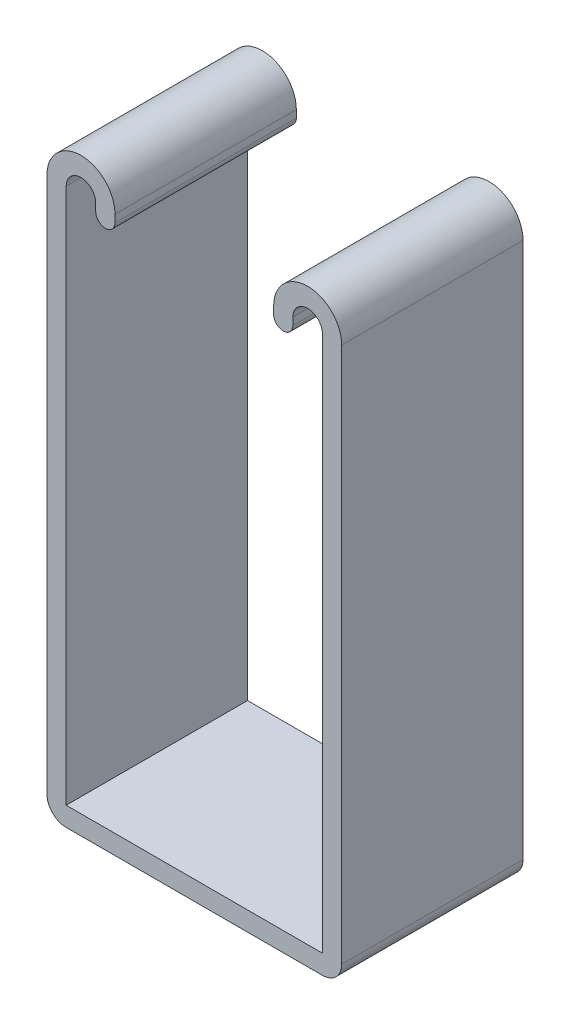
from build123d import *

# Parameters (mm, degrees)
BASE_EXTRUDE_DEPTH = 12.7


with BuildPart() as part:
    # Sketch1 → Base-Extrude (new, symmetric)
    with BuildSketch(Plane.XY):
        with BuildLine():
            Line((-20.6375, 39.6875), (-20.6375, -35.4076))
            ThreePointArc((-20.6375, -35.4076), (-19.848914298, -37.311414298), (-17.9451, -38.1))
            Line((-17.9451, -38.1), (17.9451, -38.1))
            ThreePointArc((17.9451, -38.1), (19.848914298, -37.311414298), (20.6375, -35.4076))
            Line((20.6375, -35.4076), (20.6375, 39.6875))
            ThreePointArc((20.6375, 39.6875), (15.875, 44.45), (11.1125, 39.6875))
            Line((11.1125, 39.6875), (11.1125, 38.65245))
            ThreePointArc((11.1125, 38.65245), (12.4587, 37.30625), (13.8049, 38.65245))
            Line((13.8049, 38.65245), (13.8049, 39.6875))
            ThreePointArc((13.8049, 39.6875), (15.875, 41.7576), (17.9451, 39.6875))
            Line((17.9451, 39.6875), (17.9451, -35.4076))
            Line((17.9451, -35.4076), (-17.9451, -35.4076))
            Line((-17.9451, -35.4076), (-17.9451, 39.6875))
            ThreePointArc((-17.9451, 39.6875), (-15.875, 41.7576), (-13.8049, 39.6875))
            Line((-13.8049, 39.6875), (-13.8049, 38.65245))
            ThreePointArc((-13.8049, 38.65245), (-12.4587, 37.30625), (-11.1125, 38.65245))
            Line((-11.1125, 38.65245), (-11.1125, 39.6875))
            ThreePointArc((-11.1125, 39.6875), (-15.875, 44.45), (-20.6375, 39.6875))
        make_face()
    extrude(amount=BASE_EXTRUDE_DEPTH, both=True)


solid = part.part
